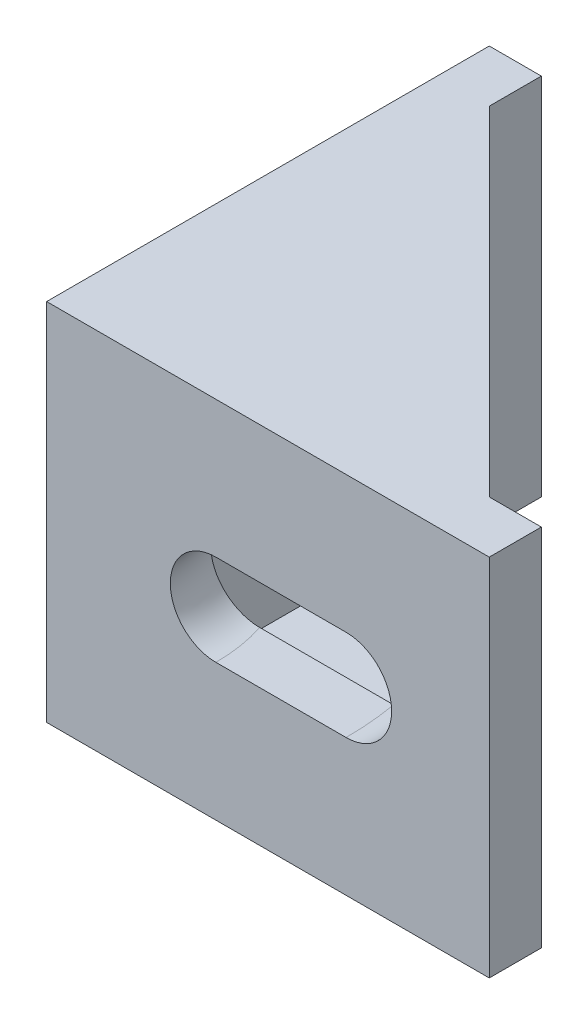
from build123d import *

# Parameters (mm, degrees)
EXTRUDE_1_DEPTH     = 28
SKETCH_2_W          = 30
SKETCH_2_H          = 24
CUT_EXTRUDE_1_DEPTH = 28
EXTRUDE_2_DEPTH     = 28


with BuildPart() as part:
    # Sketch 1 → Extrude 1 (new body)
    with BuildSketch(Plane(origin=(0, 0, 0), x_dir=(1, 0, 0), z_dir=(0, 1, 0))):
        Polygon((0, 59.897486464), (0, 25.897486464), (34, 25.897486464), align=None)
    extrude(amount=EXTRUDE_1_DEPTH)

    # Sketch 2 → Cut-Extrude 1 (cut)
    with BuildSketch(Plane.ZY.offset(-4)):
        with Locations((-44.897486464, 14)):
            Rectangle(SKETCH_2_W, SKETCH_2_H)
    extrude(amount=-CUT_EXTRUDE_1_DEPTH, mode=Mode.SUBTRACT)

    # Sketch 3 → Cut-Revolve 1 (revolve, cut)
    with BuildSketch(Plane.ZY):
        with BuildLine():
            Line((-38.897486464, 10.5), (-48.897486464, 10.5))
            ThreePointArc((-48.897486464, 10.5), (-52.397486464, 14), (-48.897486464, 17.5))
            Line((-48.897486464, 17.5), (-38.897486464, 17.5))
            ThreePointArc((-38.897486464, 17.5), (-35.397486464, 14), (-38.897486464, 10.5))
        make_face()
    revolve(axis=Axis((0, 28, -25.897486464), (0, -1, 0)), mode=Mode.SUBTRACT)

    # Sketch 4 → Extrude 2 (add)
    with BuildSketch(Plane.XZ):
        Polygon((0, -59.897486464), (4, -59.897486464), (4, -55.897486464), align=None)
        Polygon((34, -25.897486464), (34, -29.897486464), (30, -29.897486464), align=None)
    extrude(amount=-EXTRUDE_2_DEPTH)


solid = part.part
